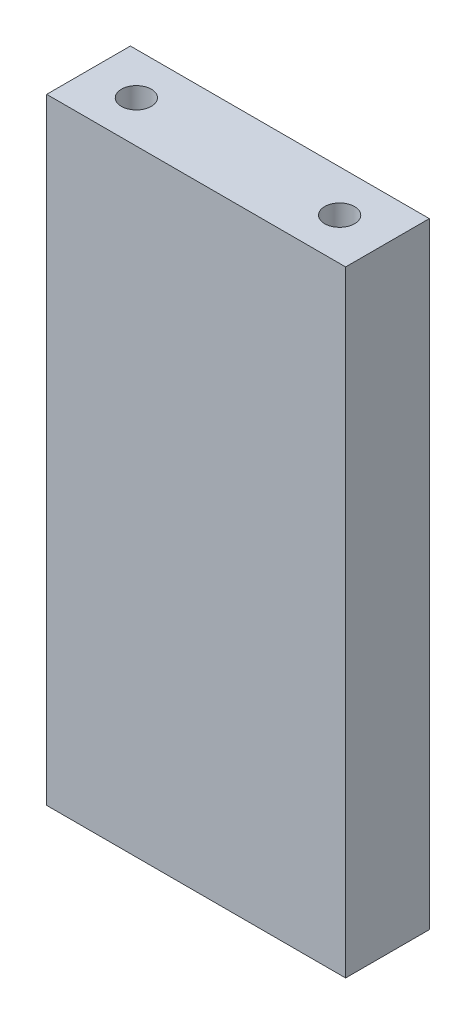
ISO-10303-21;
HEADER;
FILE_DESCRIPTION(('STEP AP214'),'2;1');
FILE_NAME('part.step','',(''),(''),'','','');
FILE_SCHEMA(('AUTOMOTIVE_DESIGN { 1 0 10303 214 1 1 1 1 }'));
ENDSEC;
DATA;
#1=APPLICATION_CONTEXT('core data for automotive mechanical design processes');
#2=APPLICATION_PROTOCOL_DEFINITION('international standard','automotive_design',2000,#1);
#3=PRODUCT_CONTEXT('',#1,'mechanical');
#4=PRODUCT('Part','Part','',(#3));
#5=PRODUCT_RELATED_PRODUCT_CATEGORY('part','',(#4));
#6=PRODUCT_DEFINITION_FORMATION('','',#4);
#7=PRODUCT_DEFINITION_CONTEXT('part definition',#1,'design');
#8=PRODUCT_DEFINITION('design','',#6,#7);
#9=PRODUCT_DEFINITION_SHAPE('','',#8);
#10=(LENGTH_UNIT() NAMED_UNIT(*) SI_UNIT(.MILLI.,.METRE.));
#11=(NAMED_UNIT(*) PLANE_ANGLE_UNIT() SI_UNIT($,.RADIAN.));
#12=(NAMED_UNIT(*) SI_UNIT($,.STERADIAN.) SOLID_ANGLE_UNIT());
#13=UNCERTAINTY_MEASURE_WITH_UNIT(LENGTH_MEASURE(1.E-05),#10,'distance_accuracy_value','');
#14=(GEOMETRIC_REPRESENTATION_CONTEXT(3) GLOBAL_UNCERTAINTY_ASSIGNED_CONTEXT((#13)) GLOBAL_UNIT_ASSIGNED_CONTEXT((#10,
#11,#12)) REPRESENTATION_CONTEXT('',''));
#15=CARTESIAN_POINT('',(0.,0.,0.));
#16=DIRECTION('',(0.,0.,1.));
#17=DIRECTION('',(1.,0.,0.));
#18=AXIS2_PLACEMENT_3D('',#15,#16,#17);
#19=CARTESIAN_POINT('',(-17.,85.9999999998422,0.));
#20=DIRECTION('',(0.,1.,0.));
#21=DIRECTION('',(0.,0.,1.));
#22=AXIS2_PLACEMENT_3D('',#19,#20,#21);
#23=CONICAL_SURFACE('',#22,2.49999999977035,1.0297442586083);
#24=CARTESIAN_POINT('',(-17.,84.4978484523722,0.));
#25=VERTEX_POINT('',#24);
#26=VERTEX_LOOP('',#25);
#27=FACE_BOUND('',#26,.T.);
#28=CARTESIAN_POINT('',(-17.,86.,0.));
#29=DIRECTION('',(0.,1.,0.));
#30=DIRECTION('',(0.,0.,1.));
#31=AXIS2_PLACEMENT_3D('',#28,#29,#30);
#32=CIRCLE('',#31,2.5);
#33=CARTESIAN_POINT('',(-17.,86.,2.5));
#34=VERTEX_POINT('',#33);
#35=EDGE_CURVE('E72',#34,#34,#32,.T.);
#36=ORIENTED_EDGE('',*,*,#35,.T.);
#37=EDGE_LOOP('',(#36));
#38=FACE_BOUND('',#37,.T.);
#39=ADVANCED_FACE('F17',(#27,#38),#23,.F.);
#40=CARTESIAN_POINT('',(17.,85.9999999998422,0.));
#41=DIRECTION('',(0.,1.,0.));
#42=DIRECTION('',(0.,0.,1.));
#43=AXIS2_PLACEMENT_3D('',#40,#41,#42);
#44=CONICAL_SURFACE('',#43,2.49999999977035,1.0297442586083);
#45=CARTESIAN_POINT('',(17.,84.4978484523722,0.));
#46=VERTEX_POINT('',#45);
#47=VERTEX_LOOP('',#46);
#48=FACE_BOUND('',#47,.T.);
#49=CARTESIAN_POINT('',(17.,86.,0.));
#50=DIRECTION('',(0.,1.,0.));
#51=DIRECTION('',(0.,0.,1.));
#52=AXIS2_PLACEMENT_3D('',#49,#50,#51);
#53=CIRCLE('',#52,2.5);
#54=CARTESIAN_POINT('',(17.,86.,2.5));
#55=VERTEX_POINT('',#54);
#56=EDGE_CURVE('E74',#55,#55,#53,.T.);
#57=ORIENTED_EDGE('',*,*,#56,.T.);
#58=EDGE_LOOP('',(#57));
#59=FACE_BOUND('',#58,.T.);
#60=ADVANCED_FACE('F69',(#48,#59),#44,.F.);
#61=CARTESIAN_POINT('',(-17.,17.0000000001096,0.));
#62=DIRECTION('',(0.,-1.,0.));
#63=DIRECTION('',(0.,0.,-1.));
#64=AXIS2_PLACEMENT_3D('',#61,#62,#63);
#65=CONICAL_SURFACE('',#64,2.49999999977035,1.02974425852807);
#66=CARTESIAN_POINT('',(-17.,18.5021515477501,8.52654724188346E-11));
#67=VERTEX_POINT('',#66);
#68=VERTEX_LOOP('',#67);
#69=FACE_BOUND('',#68,.T.);
#70=CARTESIAN_POINT('',(-17.,17.,0.));
#71=DIRECTION('',(0.,-1.,0.));
#72=DIRECTION('',(0.,0.,-1.));
#73=AXIS2_PLACEMENT_3D('',#70,#71,#72);
#74=CIRCLE('',#73,2.5);
#75=CARTESIAN_POINT('',(-17.,17.,-2.5));
#76=VERTEX_POINT('',#75);
#77=EDGE_CURVE('E77',#76,#76,#74,.T.);
#78=ORIENTED_EDGE('',*,*,#77,.T.);
#79=EDGE_LOOP('',(#78));
#80=FACE_BOUND('',#79,.T.);
#81=ADVANCED_FACE('F109',(#69,#80),#65,.F.);
#82=CARTESIAN_POINT('',(17.,17.0000000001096,0.));
#83=DIRECTION('',(0.,-1.,0.));
#84=DIRECTION('',(0.,0.,-1.));
#85=AXIS2_PLACEMENT_3D('',#82,#83,#84);
#86=CONICAL_SURFACE('',#85,2.49999999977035,1.02974425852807);
#87=CARTESIAN_POINT('',(17.,18.5021515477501,8.52652798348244E-11));
#88=VERTEX_POINT('',#87);
#89=VERTEX_LOOP('',#88);
#90=FACE_BOUND('',#89,.T.);
#91=CARTESIAN_POINT('',(17.,17.,0.));
#92=DIRECTION('',(0.,-1.,0.));
#93=DIRECTION('',(0.,0.,-1.));
#94=AXIS2_PLACEMENT_3D('',#91,#92,#93);
#95=CIRCLE('',#94,2.5);
#96=CARTESIAN_POINT('',(17.,17.,-2.5));
#97=VERTEX_POINT('',#96);
#98=EDGE_CURVE('E98',#97,#97,#95,.T.);
#99=ORIENTED_EDGE('',*,*,#98,.T.);
#100=EDGE_LOOP('',(#99));
#101=FACE_BOUND('',#100,.T.);
#102=ADVANCED_FACE('F155',(#90,#101),#86,.F.);
#103=CARTESIAN_POINT('',(-17.,103.,0.));
#104=DIRECTION('',(0.,1.,0.));
#105=DIRECTION('',(0.,0.,1.));
#106=AXIS2_PLACEMENT_3D('',#103,#104,#105);
#107=CYLINDRICAL_SURFACE('',#106,2.5);
#108=CARTESIAN_POINT('',(-17.,103.,0.));
#109=DIRECTION('',(0.,1.,0.));
#110=DIRECTION('',(0.,0.,1.));
#111=AXIS2_PLACEMENT_3D('',#108,#109,#110);
#112=CIRCLE('',#111,2.5);
#113=CARTESIAN_POINT('',(-17.,103.,2.5));
#114=VERTEX_POINT('',#113);
#115=EDGE_CURVE('E20',#114,#114,#112,.F.);
#116=ORIENTED_EDGE('',*,*,#115,.F.);
#117=EDGE_LOOP('',(#116));
#118=FACE_BOUND('',#117,.T.);
#119=ORIENTED_EDGE('',*,*,#35,.F.);
#120=EDGE_LOOP('',(#119));
#121=FACE_BOUND('',#120,.T.);
#122=ADVANCED_FACE('F151',(#118,#121),#107,.F.);
#123=CARTESIAN_POINT('',(17.,103.,0.));
#124=DIRECTION('',(0.,1.,0.));
#125=DIRECTION('',(0.,0.,1.));
#126=AXIS2_PLACEMENT_3D('',#123,#124,#125);
#127=CYLINDRICAL_SURFACE('',#126,2.5);
#128=CARTESIAN_POINT('',(17.,103.,0.));
#129=DIRECTION('',(0.,1.,0.));
#130=DIRECTION('',(0.,0.,1.));
#131=AXIS2_PLACEMENT_3D('',#128,#129,#130);
#132=CIRCLE('',#131,2.5);
#133=CARTESIAN_POINT('',(17.,103.,2.5));
#134=VERTEX_POINT('',#133);
#135=EDGE_CURVE('E87',#134,#134,#132,.F.);
#136=ORIENTED_EDGE('',*,*,#135,.F.);
#137=EDGE_LOOP('',(#136));
#138=FACE_BOUND('',#137,.T.);
#139=ORIENTED_EDGE('',*,*,#56,.F.);
#140=EDGE_LOOP('',(#139));
#141=FACE_BOUND('',#140,.T.);
#142=ADVANCED_FACE('F115',(#138,#141),#127,.F.);
#143=CARTESIAN_POINT('',(-17.,0.,0.));
#144=DIRECTION('',(0.,-1.,0.));
#145=DIRECTION('',(0.,0.,-1.));
#146=AXIS2_PLACEMENT_3D('',#143,#144,#145);
#147=CYLINDRICAL_SURFACE('',#146,2.5);
#148=ORIENTED_EDGE('',*,*,#77,.F.);
#149=EDGE_LOOP('',(#148));
#150=FACE_BOUND('',#149,.T.);
#151=CARTESIAN_POINT('',(-17.,0.,0.));
#152=DIRECTION('',(0.,-1.,0.));
#153=DIRECTION('',(0.,0.,-1.));
#154=AXIS2_PLACEMENT_3D('',#151,#152,#153);
#155=CIRCLE('',#154,2.5);
#156=CARTESIAN_POINT('',(-17.,0.,-2.5));
#157=VERTEX_POINT('',#156);
#158=EDGE_CURVE('E84',#157,#157,#155,.T.);
#159=ORIENTED_EDGE('',*,*,#158,.T.);
#160=EDGE_LOOP('',(#159));
#161=FACE_BOUND('',#160,.T.);
#162=ADVANCED_FACE('F111',(#150,#161),#147,.F.);
#163=CARTESIAN_POINT('',(17.,0.,0.));
#164=DIRECTION('',(0.,-1.,0.));
#165=DIRECTION('',(0.,0.,-1.));
#166=AXIS2_PLACEMENT_3D('',#163,#164,#165);
#167=CYLINDRICAL_SURFACE('',#166,2.5);
#168=ORIENTED_EDGE('',*,*,#98,.F.);
#169=EDGE_LOOP('',(#168));
#170=FACE_BOUND('',#169,.T.);
#171=CARTESIAN_POINT('',(17.,0.,0.));
#172=DIRECTION('',(0.,-1.,0.));
#173=DIRECTION('',(0.,0.,-1.));
#174=AXIS2_PLACEMENT_3D('',#171,#172,#173);
#175=CIRCLE('',#174,2.5);
#176=CARTESIAN_POINT('',(17.,0.,-2.5));
#177=VERTEX_POINT('',#176);
#178=EDGE_CURVE('E81',#177,#177,#175,.T.);
#179=ORIENTED_EDGE('',*,*,#178,.T.);
#180=EDGE_LOOP('',(#179));
#181=FACE_BOUND('',#180,.T.);
#182=ADVANCED_FACE('F114',(#170,#181),#167,.F.);
#183=CARTESIAN_POINT('',(-25.,103.,7.));
#184=DIRECTION('',(0.,0.,-1.));
#185=DIRECTION('',(-1.,0.,0.));
#186=AXIS2_PLACEMENT_3D('',#183,#184,#185);
#187=PLANE('',#186);
#188=DIRECTION('',(0.,1.,0.));
#189=VECTOR('',#188,1.);
#190=CARTESIAN_POINT('',(25.,103.,7.));
#191=LINE('',#190,#189);
#192=CARTESIAN_POINT('',(25.,0.,7.));
#193=VERTEX_POINT('',#192);
#194=CARTESIAN_POINT('',(25.,103.,7.));
#195=VERTEX_POINT('',#194);
#196=EDGE_CURVE('E95',#193,#195,#191,.T.);
#197=ORIENTED_EDGE('',*,*,#196,.T.);
#198=DIRECTION('',(1.,0.,0.));
#199=VECTOR('',#198,1.);
#200=CARTESIAN_POINT('',(0.,103.,7.));
#201=LINE('',#200,#199);
#202=CARTESIAN_POINT('',(-25.,103.,7.));
#203=VERTEX_POINT('',#202);
#204=EDGE_CURVE('E92',#203,#195,#201,.T.);
#205=ORIENTED_EDGE('',*,*,#204,.F.);
#206=DIRECTION('',(0.,1.,0.));
#207=VECTOR('',#206,1.);
#208=CARTESIAN_POINT('',(-25.,103.,7.));
#209=LINE('',#208,#207);
#210=CARTESIAN_POINT('',(-25.,0.,7.));
#211=VERTEX_POINT('',#210);
#212=EDGE_CURVE('E86',#203,#211,#209,.F.);
#213=ORIENTED_EDGE('',*,*,#212,.T.);
#214=DIRECTION('',(1.,0.,0.));
#215=VECTOR('',#214,1.);
#216=CARTESIAN_POINT('',(0.,0.,7.));
#217=LINE('',#216,#215);
#218=EDGE_CURVE('E305',#211,#193,#217,.T.);
#219=ORIENTED_EDGE('',*,*,#218,.T.);
#220=EDGE_LOOP('',(#197,#205,#213,#219));
#221=FACE_BOUND('',#220,.T.);
#222=ADVANCED_FACE('F142',(#221),#187,.F.);
#223=CARTESIAN_POINT('',(25.,103.,-7.));
#224=DIRECTION('',(-1.,0.,0.));
#225=DIRECTION('',(0.,0.,1.));
#226=AXIS2_PLACEMENT_3D('',#223,#224,#225);
#227=PLANE('',#226);
#228=DIRECTION('',(0.,1.,0.));
#229=VECTOR('',#228,1.);
#230=CARTESIAN_POINT('',(25.,103.,-7.));
#231=LINE('',#230,#229);
#232=CARTESIAN_POINT('',(25.,0.,-7.));
#233=VERTEX_POINT('',#232);
#234=CARTESIAN_POINT('',(25.,103.,-7.));
#235=VERTEX_POINT('',#234);
#236=EDGE_CURVE('E297',#233,#235,#231,.T.);
#237=ORIENTED_EDGE('',*,*,#236,.T.);
#238=DIRECTION('',(0.,0.,1.));
#239=VECTOR('',#238,1.);
#240=CARTESIAN_POINT('',(25.,103.,0.));
#241=LINE('',#240,#239);
#242=EDGE_CURVE('E89',#195,#235,#241,.F.);
#243=ORIENTED_EDGE('',*,*,#242,.F.);
#244=ORIENTED_EDGE('',*,*,#196,.F.);
#245=DIRECTION('',(0.,0.,1.));
#246=VECTOR('',#245,1.);
#247=CARTESIAN_POINT('',(25.,0.,0.));
#248=LINE('',#247,#246);
#249=EDGE_CURVE('E299',#193,#233,#248,.F.);
#250=ORIENTED_EDGE('',*,*,#249,.T.);
#251=EDGE_LOOP('',(#237,#243,#244,#250));
#252=FACE_BOUND('',#251,.T.);
#253=ADVANCED_FACE('F138',(#252),#227,.F.);
#254=CARTESIAN_POINT('',(0.,103.,0.));
#255=DIRECTION('',(0.,1.,0.));
#256=DIRECTION('',(0.,0.,1.));
#257=AXIS2_PLACEMENT_3D('',#254,#255,#256);
#258=PLANE('',#257);
#259=DIRECTION('',(0.,0.,-1.));
#260=VECTOR('',#259,1.);
#261=CARTESIAN_POINT('',(-25.,103.,-7.));
#262=LINE('',#261,#260);
#263=CARTESIAN_POINT('',(-25.,103.,-7.));
#264=VERTEX_POINT('',#263);
#265=EDGE_CURVE('E312',#264,#203,#262,.F.);
#266=ORIENTED_EDGE('',*,*,#265,.T.);
#267=ORIENTED_EDGE('',*,*,#204,.T.);
#268=ORIENTED_EDGE('',*,*,#242,.T.);
#269=DIRECTION('',(1.,0.,0.));
#270=VECTOR('',#269,1.);
#271=CARTESIAN_POINT('',(-25.,103.,-7.));
#272=LINE('',#271,#270);
#273=EDGE_CURVE('E301',#235,#264,#272,.F.);
#274=ORIENTED_EDGE('',*,*,#273,.T.);
#275=EDGE_LOOP('',(#266,#267,#268,#274));
#276=FACE_BOUND('',#275,.T.);
#277=ORIENTED_EDGE('',*,*,#135,.T.);
#278=EDGE_LOOP('',(#277));
#279=FACE_BOUND('',#278,.T.);
#280=ORIENTED_EDGE('',*,*,#115,.T.);
#281=EDGE_LOOP('',(#280));
#282=FACE_BOUND('',#281,.T.);
#283=ADVANCED_FACE('F131',(#276,#279,#282),#258,.T.);
#284=CARTESIAN_POINT('',(-25.,103.,-7.));
#285=DIRECTION('',(1.,0.,0.));
#286=DIRECTION('',(0.,0.,-1.));
#287=AXIS2_PLACEMENT_3D('',#284,#285,#286);
#288=PLANE('',#287);
#289=ORIENTED_EDGE('',*,*,#212,.F.);
#290=ORIENTED_EDGE('',*,*,#265,.F.);
#291=DIRECTION('',(0.,1.,0.));
#292=VECTOR('',#291,1.);
#293=CARTESIAN_POINT('',(-25.,103.,-7.));
#294=LINE('',#293,#292);
#295=CARTESIAN_POINT('',(-25.,0.,-7.));
#296=VERTEX_POINT('',#295);
#297=EDGE_CURVE('E26',#264,#296,#294,.F.);
#298=ORIENTED_EDGE('',*,*,#297,.T.);
#299=DIRECTION('',(0.,0.,1.));
#300=VECTOR('',#299,1.);
#301=CARTESIAN_POINT('',(-25.,0.,0.));
#302=LINE('',#301,#300);
#303=EDGE_CURVE('E34',#296,#211,#302,.T.);
#304=ORIENTED_EDGE('',*,*,#303,.T.);
#305=EDGE_LOOP('',(#289,#290,#298,#304));
#306=FACE_BOUND('',#305,.T.);
#307=ADVANCED_FACE('F122',(#306),#288,.F.);
#308=CARTESIAN_POINT('',(0.,0.,0.));
#309=DIRECTION('',(0.,1.,0.));
#310=DIRECTION('',(0.,0.,1.));
#311=AXIS2_PLACEMENT_3D('',#308,#309,#310);
#312=PLANE('',#311);
#313=ORIENTED_EDGE('',*,*,#218,.F.);
#314=ORIENTED_EDGE('',*,*,#303,.F.);
#315=DIRECTION('',(1.,0.,0.));
#316=VECTOR('',#315,1.);
#317=CARTESIAN_POINT('',(-25.,0.,-7.));
#318=LINE('',#317,#316);
#319=EDGE_CURVE('E11',#296,#233,#318,.T.);
#320=ORIENTED_EDGE('',*,*,#319,.T.);
#321=ORIENTED_EDGE('',*,*,#249,.F.);
#322=EDGE_LOOP('',(#313,#314,#320,#321));
#323=FACE_BOUND('',#322,.T.);
#324=ORIENTED_EDGE('',*,*,#178,.F.);
#325=EDGE_LOOP('',(#324));
#326=FACE_BOUND('',#325,.T.);
#327=ORIENTED_EDGE('',*,*,#158,.F.);
#328=EDGE_LOOP('',(#327));
#329=FACE_BOUND('',#328,.T.);
#330=ADVANCED_FACE('F119',(#323,#326,#329),#312,.F.);
#331=CARTESIAN_POINT('',(-25.,103.,-7.));
#332=DIRECTION('',(0.,0.,1.));
#333=DIRECTION('',(1.,0.,0.));
#334=AXIS2_PLACEMENT_3D('',#331,#332,#333);
#335=PLANE('',#334);
#336=ORIENTED_EDGE('',*,*,#297,.F.);
#337=ORIENTED_EDGE('',*,*,#273,.F.);
#338=ORIENTED_EDGE('',*,*,#236,.F.);
#339=ORIENTED_EDGE('',*,*,#319,.F.);
#340=EDGE_LOOP('',(#336,#337,#338,#339));
#341=FACE_BOUND('',#340,.T.);
#342=ADVANCED_FACE('F121',(#341),#335,.F.);
#343=CLOSED_SHELL('',(#39,#60,#81,#102,#122,#142,#162,#182,#222,#253,#283,#307,#330,#342));
#344=MANIFOLD_SOLID_BREP('B1',#343);
#345=ADVANCED_BREP_SHAPE_REPRESENTATION('',(#18,#344),#14);
#346=SHAPE_DEFINITION_REPRESENTATION(#9,#345);
ENDSEC;
END-ISO-10303-21;
